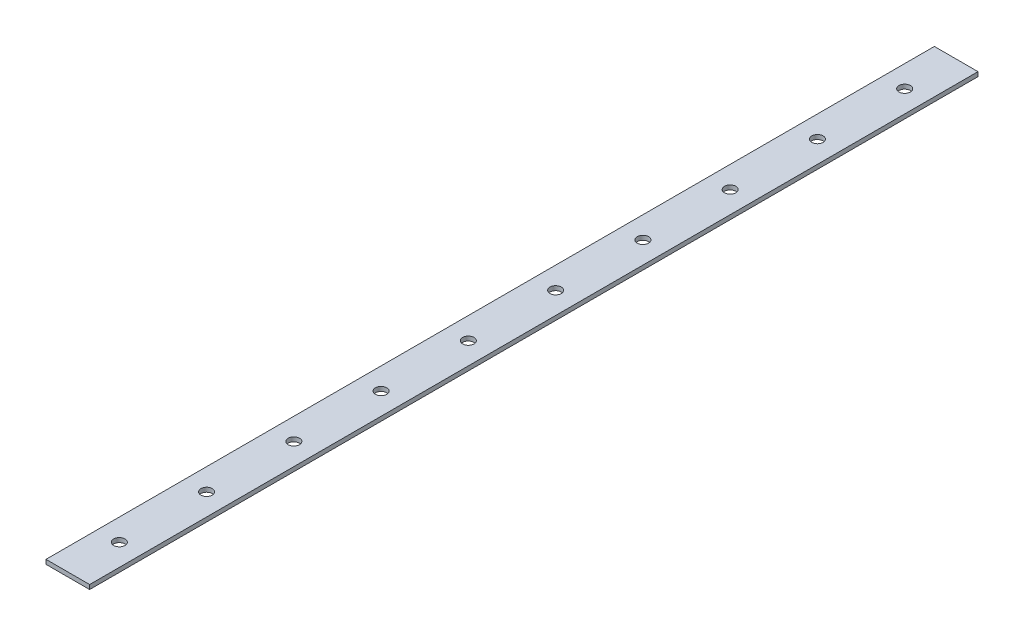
from build123d import *

# Parameters (mm, degrees)
ESQUISSE1_W             = 50
ESQUISSE1_H             = 5
EXTRUSION1_DEPTH        = 509
ESQUISSE2_R             = 6.5
ENL_V_MAT_EXTRU_1_DEPTH = 510.638106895


with BuildPart() as part:
    # Esquisse1 → Extrusion1 (new, symmetric)
    with BuildSketch(Plane.XY):
        Rectangle(ESQUISSE1_W, ESQUISSE1_H)
    extrude(amount=EXTRUSION1_DEPTH, both=True)

    # Esquisse2 → Enl_v. mat.-Extru.1 (cut, through all)
    with BuildSketch(Plane(origin=(0, 2.5, 0), x_dir=(-1, 0, 0), z_dir=(0, 1, 0))):
        with Locations(Location((0, -450, 0), (0, 0, 90))):
            Circle(ESQUISSE2_R)
        with Locations(Location((0, -350, 0), (0, 0, 90))):
            Circle(ESQUISSE2_R)
        with Locations(Location((0, -250, 0), (0, 0, 90))):
            Circle(ESQUISSE2_R)
        with Locations(Location((0, -150, 0), (0, 0, 90))):
            Circle(ESQUISSE2_R)
        with Locations(Location((0, -50, 0), (0, 0, 90))):
            Circle(ESQUISSE2_R)
        with Locations(Location((0, 50, 0), (0, 0, 90))):
            Circle(ESQUISSE2_R)
        with Locations(Location((0, 150, 0), (0, 0, 90))):
            Circle(ESQUISSE2_R)
        with Locations(Location((0, 250, 0), (0, 0, 90))):
            Circle(ESQUISSE2_R)
        with Locations(Location((0, 350, 0), (0, 0, 90))):
            Circle(ESQUISSE2_R)
        with Locations(Location((0, 450, 0), (0, 0, 90))):
            Circle(ESQUISSE2_R)
    extrude(amount=-ENL_V_MAT_EXTRU_1_DEPTH, mode=Mode.SUBTRACT)


solid = part.part
